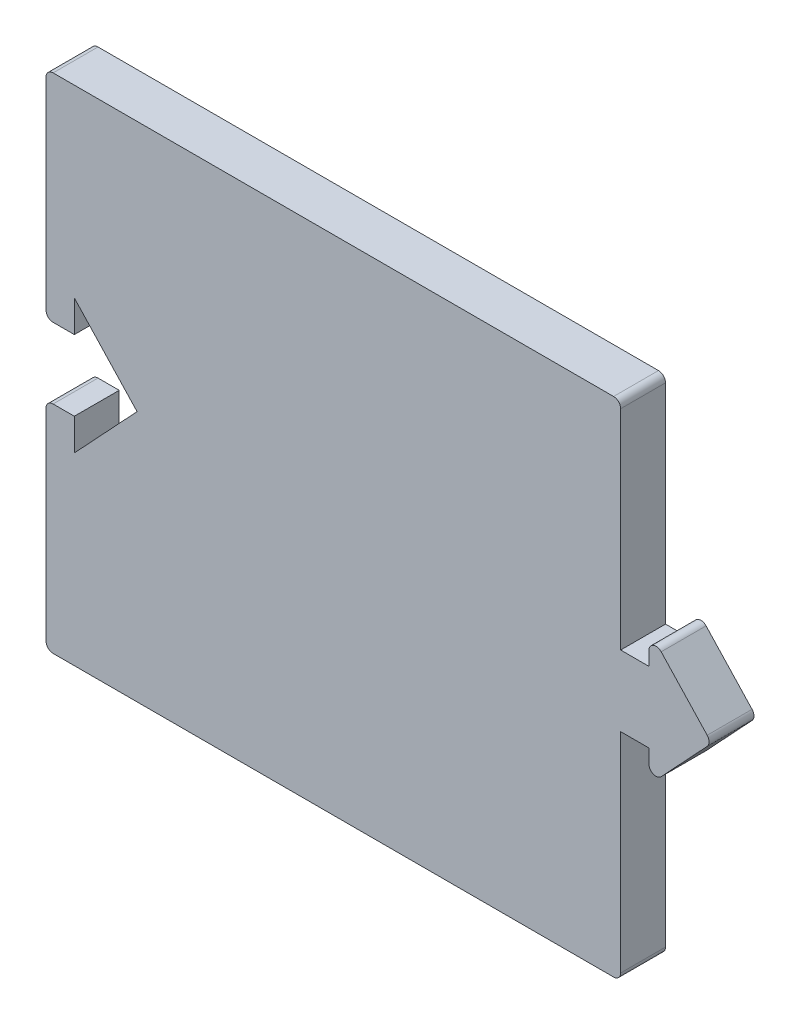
from build123d import *

# Parameters (mm, degrees)
BOSS_EXTRUDE1_DEPTH = 3.175
FILLET1_R           = 0.5


with BuildPart() as part:
    # Sketch1 → Boss-Extrude1 (new body)
    with BuildSketch(Plane.XY):
        Polygon((40.64, 35.56), (40.64, 20.28), (42.64, 20.28), (42.64, 22.53), (47.077059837, 17.78), (42.64, 13.03), (42.64, 15.28), (40.64, 15.28), (40.64, 0), (0, 0), (0, 15.28), (2, 15.28), (2, 13.03), (6.437059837, 17.78), (2, 22.53), (2, 20.28), (0, 20.28), (0, 35.56), align=None)
    extrude(amount=BOSS_EXTRUDE1_DEPTH)

    # Fillet1
    fillet1_edges = [part.edges().sort_by_distance(p)[0] for p in [
        (0, 15.28, 1.5875),
        (0, 20.28, 1.5875),
        (0, 35.56, 1.5875),
        (40.64, 35.56, 1.5875),
        (42.64, 22.53, 1.5875),
        (47.077059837, 17.78, 1.5875),
        (42.64, 13.03, 1.5875),
        (40.64, 0, 1.5875),
        (0, 0, 1.5875),
    ]]
    fillet(fillet1_edges, radius=FILLET1_R)


solid = part.part
